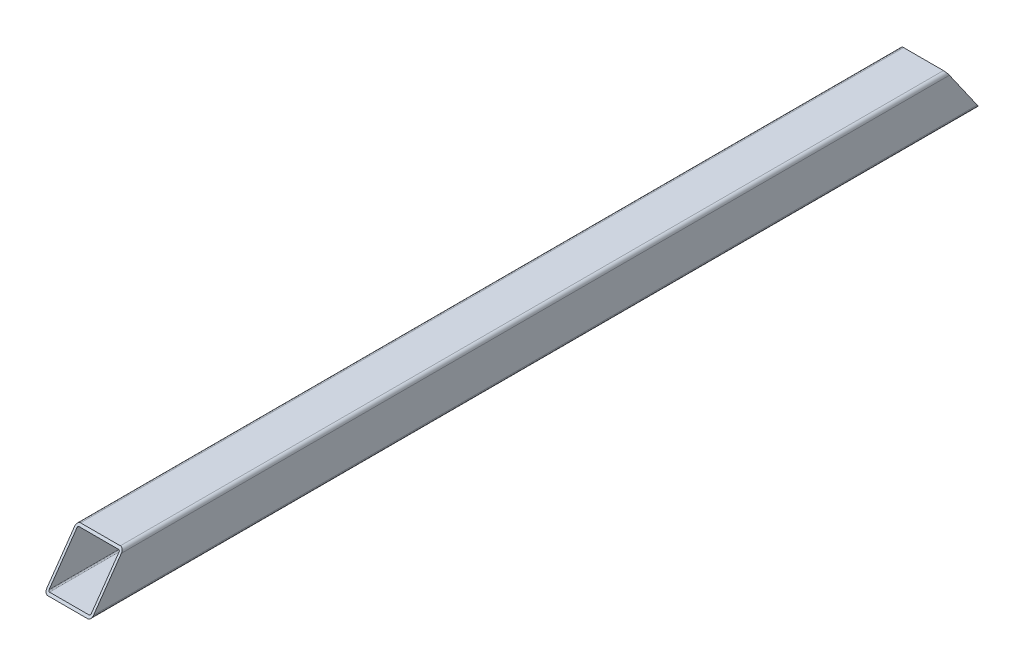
from build123d import *

# Parameters (mm, degrees)
BASE_EXTRUSION_DEPTH    = 760
ENL_V_MAT_EXTRU_1_DEPTH = 763.10235533
ENL_V_MAT_EXTRU_2_DEPTH = 763.10235533


with BuildPart() as part:
    # Esquisse1 → Base-Extrusion (new body)
    with BuildSketch(Plane.XY):
        with BuildLine():
            Line((3, 0), (37, 0))
            ThreePointArc((37, 0), (39.121320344, -0.878679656), (40, -3))
            Line((40, -3), (40, -37))
            ThreePointArc((40, -37), (39.121320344, -39.121320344), (37, -40))
            Line((37, -40), (3, -40))
            ThreePointArc((3, -40), (0.878679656, -39.121320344), (0, -37))
            Line((0, -37), (0, -3))
            ThreePointArc((0, -3), (0.878679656, -0.878679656), (3, 0))
        make_face()
        with BuildLine():
            Line((2, -3), (2, -37))
            ThreePointArc((2, -37), (2.292893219, -37.707106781), (3, -38))
            Line((3, -38), (37, -38))
            ThreePointArc((37, -38), (37.707106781, -37.707106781), (38, -37))
            Line((38, -37), (38, -3))
            ThreePointArc((38, -3), (37.707106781, -2.292893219), (37, -2))
            Line((37, -2), (3, -2))
            ThreePointArc((3, -2), (2.292893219, -2.292893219), (2, -3))
        make_face(mode=Mode.SUBTRACT)
    extrude(amount=BASE_EXTRUSION_DEPTH)

    # Esquisse2 → Enl_v. mat.-Extru.1 (cut, through all)
    with BuildSketch(Plane.ZY):
        Polygon((0, 0), (0, -40), (28.008301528, 0), align=None)
    extrude(amount=-ENL_V_MAT_EXTRU_1_DEPTH, mode=Mode.SUBTRACT)

    # Esquisse3 → Enl_v. mat.-Extru.2 (cut, through all)
    with BuildSketch(Plane.ZY):
        Polygon((731.991698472, 0), (760, -40), (760, 0), align=None)
    extrude(amount=-ENL_V_MAT_EXTRU_2_DEPTH, mode=Mode.SUBTRACT)


solid = part.part
